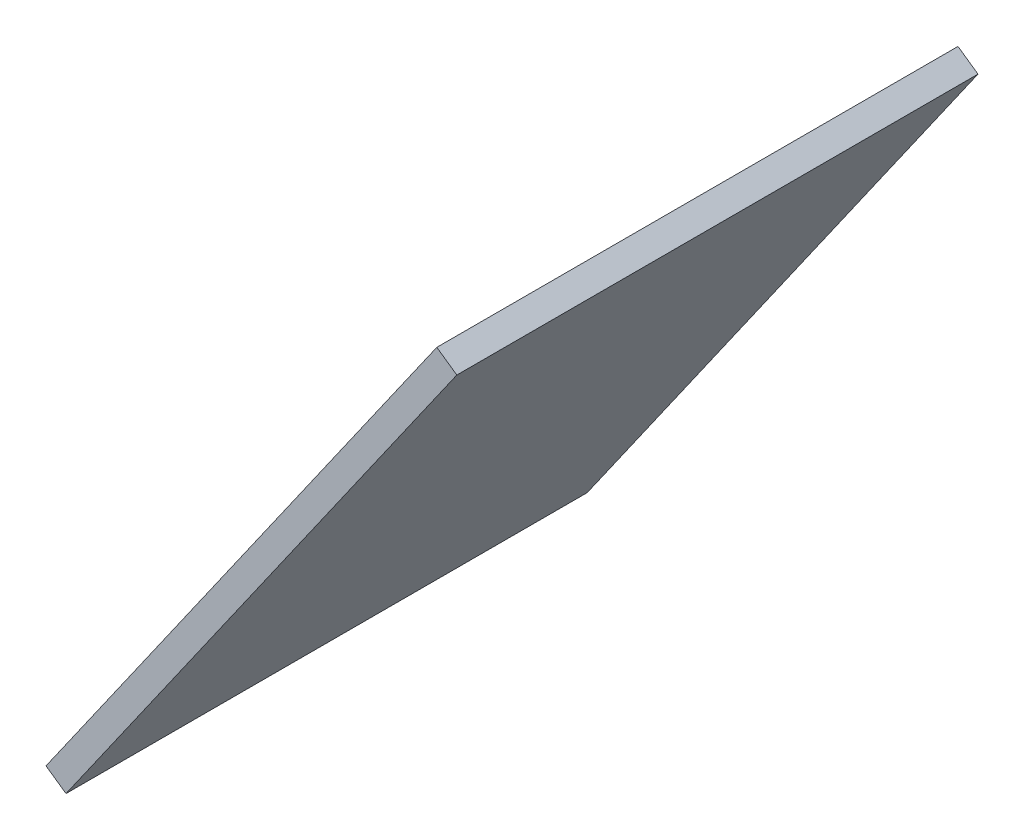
ISO-10303-21;
HEADER;
FILE_DESCRIPTION(('STEP AP214'),'2;1');
FILE_NAME('part.step','',(''),(''),'','','');
FILE_SCHEMA(('AUTOMOTIVE_DESIGN { 1 0 10303 214 1 1 1 1 }'));
ENDSEC;
DATA;
#1=APPLICATION_CONTEXT('core data for automotive mechanical design processes');
#2=APPLICATION_PROTOCOL_DEFINITION('international standard','automotive_design',2000,#1);
#3=PRODUCT_CONTEXT('',#1,'mechanical');
#4=PRODUCT('Part','Part','',(#3));
#5=PRODUCT_RELATED_PRODUCT_CATEGORY('part','',(#4));
#6=PRODUCT_DEFINITION_FORMATION('','',#4);
#7=PRODUCT_DEFINITION_CONTEXT('part definition',#1,'design');
#8=PRODUCT_DEFINITION('design','',#6,#7);
#9=PRODUCT_DEFINITION_SHAPE('','',#8);
#10=(LENGTH_UNIT() NAMED_UNIT(*) SI_UNIT(.MILLI.,.METRE.));
#11=(NAMED_UNIT(*) PLANE_ANGLE_UNIT() SI_UNIT($,.RADIAN.));
#12=(NAMED_UNIT(*) SI_UNIT($,.STERADIAN.) SOLID_ANGLE_UNIT());
#13=UNCERTAINTY_MEASURE_WITH_UNIT(LENGTH_MEASURE(1.E-05),#10,'distance_accuracy_value','');
#14=(GEOMETRIC_REPRESENTATION_CONTEXT(3) GLOBAL_UNCERTAINTY_ASSIGNED_CONTEXT((#13)) GLOBAL_UNIT_ASSIGNED_CONTEXT((#10,
#11,#12)) REPRESENTATION_CONTEXT('',''));
#15=CARTESIAN_POINT('',(0.,0.,0.));
#16=DIRECTION('',(0.,0.,1.));
#17=DIRECTION('',(1.,0.,0.));
#18=AXIS2_PLACEMENT_3D('',#15,#16,#17);
#19=CARTESIAN_POINT('',(-4447.77738641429,17434.4545002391,1567.96203116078));
#20=DIRECTION('',(0.573759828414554,0.819023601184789,0.));
#21=DIRECTION('',(-0.81902360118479,0.573759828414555,0.));
#22=AXIS2_PLACEMENT_3D('',#19,#20,#21);
#23=PLANE('',#22);
#24=DIRECTION('',(0.819023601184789,-0.573759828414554,0.));
#25=VECTOR('',#24,1.);
#26=CARTESIAN_POINT('',(-4447.77738641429,17434.4545002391,67.9620311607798));
#27=LINE('',#26,#25);
#28=CARTESIAN_POINT('',(-4447.77738641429,17434.4545002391,67.9620311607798));
#29=VERTEX_POINT('',#28);
#30=CARTESIAN_POINT('',(-4390.23574170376,17394.1442037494,67.9620311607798));
#31=VERTEX_POINT('',#30);
#32=EDGE_CURVE('E96',#29,#31,#27,.T.);
#33=ORIENTED_EDGE('',*,*,#32,.T.);
#34=DIRECTION('',(0.,0.,-1.));
#35=VECTOR('',#34,1.);
#36=CARTESIAN_POINT('',(-4390.23574170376,17394.1442037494,1567.96203116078));
#37=LINE('',#36,#35);
#38=CARTESIAN_POINT('',(-4390.23574170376,17394.1442037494,1567.96203116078));
#39=VERTEX_POINT('',#38);
#40=EDGE_CURVE('E11',#39,#31,#37,.T.);
#41=ORIENTED_EDGE('',*,*,#40,.F.);
#42=DIRECTION('',(0.819023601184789,-0.573759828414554,0.));
#43=VECTOR('',#42,1.);
#44=CARTESIAN_POINT('',(-4447.77738641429,17434.4545002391,1567.96203116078));
#45=LINE('',#44,#43);
#46=CARTESIAN_POINT('',(-4447.77738641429,17434.4545002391,1567.96203116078));
#47=VERTEX_POINT('',#46);
#48=EDGE_CURVE('E84',#47,#39,#45,.T.);
#49=ORIENTED_EDGE('',*,*,#48,.F.);
#50=DIRECTION('',(0.,0.,-1.));
#51=VECTOR('',#50,1.);
#52=CARTESIAN_POINT('',(-4447.77738641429,17434.4545002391,1567.96203116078));
#53=LINE('',#52,#51);
#54=EDGE_CURVE('E92',#47,#29,#53,.T.);
#55=ORIENTED_EDGE('',*,*,#54,.T.);
#56=EDGE_LOOP('',(#33,#41,#49,#55));
#57=FACE_BOUND('',#56,.T.);
#58=ADVANCED_FACE('F33',(#57),#23,.F.);
#59=CARTESIAN_POINT('',(-4390.23574170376,17394.1442037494,1567.96203116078));
#60=DIRECTION('',(-0.819023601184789,0.573759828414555,0.));
#61=DIRECTION('',(-0.573759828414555,-0.819023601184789,0.));
#62=AXIS2_PLACEMENT_3D('',#59,#60,#61);
#63=PLANE('',#62);
#64=DIRECTION('',(0.573759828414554,0.819023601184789,0.));
#65=VECTOR('',#64,1.);
#66=CARTESIAN_POINT('',(-4390.23574170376,17394.1442037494,67.9620311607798));
#67=LINE('',#66,#65);
#68=CARTESIAN_POINT('',(-3265.41038327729,18999.7960290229,67.9620311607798));
#69=VERTEX_POINT('',#68);
#70=EDGE_CURVE('E88',#31,#69,#67,.T.);
#71=ORIENTED_EDGE('',*,*,#70,.T.);
#72=DIRECTION('',(0.,0.,-1.));
#73=VECTOR('',#72,1.);
#74=CARTESIAN_POINT('',(-3265.41038327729,18999.7960290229,1567.96203116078));
#75=LINE('',#74,#73);
#76=CARTESIAN_POINT('',(-3265.41038327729,18999.7960290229,1567.96203116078));
#77=VERTEX_POINT('',#76);
#78=EDGE_CURVE('E41',#77,#69,#75,.T.);
#79=ORIENTED_EDGE('',*,*,#78,.F.);
#80=DIRECTION('',(0.573759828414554,0.819023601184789,0.));
#81=VECTOR('',#80,1.);
#82=CARTESIAN_POINT('',(-4390.23574170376,17394.1442037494,1567.96203116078));
#83=LINE('',#82,#81);
#84=EDGE_CURVE('E79',#39,#77,#83,.T.);
#85=ORIENTED_EDGE('',*,*,#84,.F.);
#86=ORIENTED_EDGE('',*,*,#40,.T.);
#87=EDGE_LOOP('',(#71,#79,#85,#86));
#88=FACE_BOUND('',#87,.T.);
#89=ADVANCED_FACE('F87',(#88),#63,.F.);
#90=CARTESIAN_POINT('',(-3322.95202798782,19040.1063255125,1567.96203116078));
#91=DIRECTION('',(-0.573759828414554,-0.819023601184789,0.));
#92=DIRECTION('',(0.81902360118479,-0.573759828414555,0.));
#93=AXIS2_PLACEMENT_3D('',#90,#91,#92);
#94=PLANE('',#93);
#95=DIRECTION('',(-0.819023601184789,0.573759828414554,0.));
#96=VECTOR('',#95,1.);
#97=CARTESIAN_POINT('',(-3322.95202798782,19040.1063255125,67.9620311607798));
#98=LINE('',#97,#96);
#99=CARTESIAN_POINT('',(-3322.95202798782,19040.1063255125,67.9620311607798));
#100=VERTEX_POINT('',#99);
#101=EDGE_CURVE('E66',#69,#100,#98,.T.);
#102=ORIENTED_EDGE('',*,*,#101,.T.);
#103=DIRECTION('',(0.,0.,-1.));
#104=VECTOR('',#103,1.);
#105=CARTESIAN_POINT('',(-3322.95202798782,19040.1063255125,1567.96203116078));
#106=LINE('',#105,#104);
#107=CARTESIAN_POINT('',(-3322.95202798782,19040.1063255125,1567.96203116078));
#108=VERTEX_POINT('',#107);
#109=EDGE_CURVE('E89',#108,#100,#106,.T.);
#110=ORIENTED_EDGE('',*,*,#109,.F.);
#111=DIRECTION('',(-0.819023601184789,0.573759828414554,0.));
#112=VECTOR('',#111,1.);
#113=CARTESIAN_POINT('',(-3322.95202798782,19040.1063255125,1567.96203116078));
#114=LINE('',#113,#112);
#115=EDGE_CURVE('E82',#77,#108,#114,.T.);
#116=ORIENTED_EDGE('',*,*,#115,.F.);
#117=ORIENTED_EDGE('',*,*,#78,.T.);
#118=EDGE_LOOP('',(#102,#110,#116,#117));
#119=FACE_BOUND('',#118,.T.);
#120=ADVANCED_FACE('F90',(#119),#94,.F.);
#121=CARTESIAN_POINT('',(-4447.77738641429,17434.4545002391,1567.96203116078));
#122=DIRECTION('',(0.819023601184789,-0.573759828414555,0.));
#123=DIRECTION('',(0.573759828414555,0.819023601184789,0.));
#124=AXIS2_PLACEMENT_3D('',#121,#122,#123);
#125=PLANE('',#124);
#126=DIRECTION('',(-0.573759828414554,-0.819023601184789,0.));
#127=VECTOR('',#126,1.);
#128=CARTESIAN_POINT('',(-4447.77738641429,17434.4545002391,67.9620311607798));
#129=LINE('',#128,#127);
#130=EDGE_CURVE('E72',#100,#29,#129,.T.);
#131=ORIENTED_EDGE('',*,*,#130,.T.);
#132=ORIENTED_EDGE('',*,*,#54,.F.);
#133=DIRECTION('',(-0.573759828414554,-0.819023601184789,0.));
#134=VECTOR('',#133,1.);
#135=CARTESIAN_POINT('',(-4447.77738641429,17434.4545002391,1567.96203116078));
#136=LINE('',#135,#134);
#137=EDGE_CURVE('E49',#108,#47,#136,.T.);
#138=ORIENTED_EDGE('',*,*,#137,.F.);
#139=ORIENTED_EDGE('',*,*,#109,.T.);
#140=EDGE_LOOP('',(#131,#132,#138,#139));
#141=FACE_BOUND('',#140,.T.);
#142=ADVANCED_FACE('F103',(#141),#125,.F.);
#143=CARTESIAN_POINT('',(0.,0.,1567.96203116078));
#144=DIRECTION('',(0.,0.,1.));
#145=DIRECTION('',(1.,0.,0.));
#146=AXIS2_PLACEMENT_3D('',#143,#144,#145);
#147=PLANE('',#146);
#148=ORIENTED_EDGE('',*,*,#48,.T.);
#149=ORIENTED_EDGE('',*,*,#84,.T.);
#150=ORIENTED_EDGE('',*,*,#115,.T.);
#151=ORIENTED_EDGE('',*,*,#137,.T.);
#152=EDGE_LOOP('',(#148,#149,#150,#151));
#153=FACE_BOUND('',#152,.T.);
#154=ADVANCED_FACE('F80',(#153),#147,.T.);
#155=CARTESIAN_POINT('',(0.,0.,67.9620311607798));
#156=DIRECTION('',(0.,0.,1.));
#157=DIRECTION('',(1.,0.,0.));
#158=AXIS2_PLACEMENT_3D('',#155,#156,#157);
#159=PLANE('',#158);
#160=ORIENTED_EDGE('',*,*,#32,.F.);
#161=ORIENTED_EDGE('',*,*,#130,.F.);
#162=ORIENTED_EDGE('',*,*,#101,.F.);
#163=ORIENTED_EDGE('',*,*,#70,.F.);
#164=EDGE_LOOP('',(#160,#161,#162,#163));
#165=FACE_BOUND('',#164,.T.);
#166=ADVANCED_FACE('F106',(#165),#159,.F.);
#167=CLOSED_SHELL('',(#58,#89,#120,#142,#154,#166));
#168=MANIFOLD_SOLID_BREP('B2',#167);
#169=ADVANCED_BREP_SHAPE_REPRESENTATION('',(#18,#168),#14);
#170=SHAPE_DEFINITION_REPRESENTATION(#9,#169);
ENDSEC;
END-ISO-10303-21;
